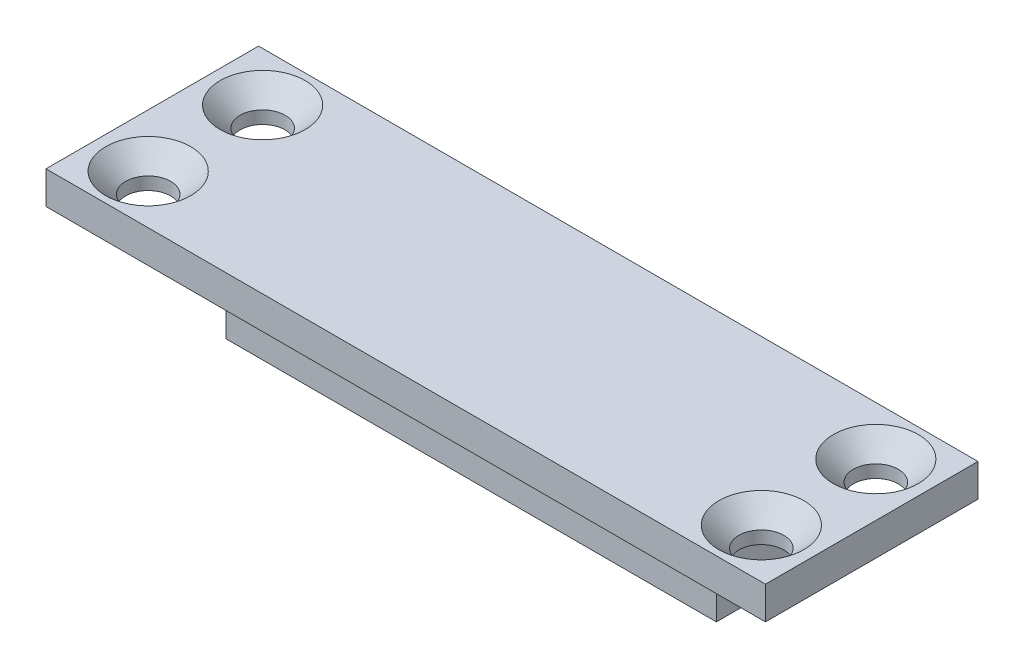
ISO-10303-21;
HEADER;
FILE_DESCRIPTION(('STEP AP214'),'2;1');
FILE_NAME('part.step','',(''),(''),'','','');
FILE_SCHEMA(('AUTOMOTIVE_DESIGN { 1 0 10303 214 1 1 1 1 }'));
ENDSEC;
DATA;
#1=APPLICATION_CONTEXT('core data for automotive mechanical design processes');
#2=APPLICATION_PROTOCOL_DEFINITION('international standard','automotive_design',2000,#1);
#3=PRODUCT_CONTEXT('',#1,'mechanical');
#4=PRODUCT('Part','Part','',(#3));
#5=PRODUCT_RELATED_PRODUCT_CATEGORY('part','',(#4));
#6=PRODUCT_DEFINITION_FORMATION('','',#4);
#7=PRODUCT_DEFINITION_CONTEXT('part definition',#1,'design');
#8=PRODUCT_DEFINITION('design','',#6,#7);
#9=PRODUCT_DEFINITION_SHAPE('','',#8);
#10=(LENGTH_UNIT() NAMED_UNIT(*) SI_UNIT(.MILLI.,.METRE.));
#11=(NAMED_UNIT(*) PLANE_ANGLE_UNIT() SI_UNIT($,.RADIAN.));
#12=(NAMED_UNIT(*) SI_UNIT($,.STERADIAN.) SOLID_ANGLE_UNIT());
#13=UNCERTAINTY_MEASURE_WITH_UNIT(LENGTH_MEASURE(1.E-05),#10,'distance_accuracy_value','');
#14=(GEOMETRIC_REPRESENTATION_CONTEXT(3) GLOBAL_UNCERTAINTY_ASSIGNED_CONTEXT((#13)) GLOBAL_UNIT_ASSIGNED_CONTEXT((#10,
#11,#12)) REPRESENTATION_CONTEXT('',''));
#15=CARTESIAN_POINT('',(0.,0.,0.));
#16=DIRECTION('',(0.,0.,1.));
#17=DIRECTION('',(1.,0.,0.));
#18=AXIS2_PLACEMENT_3D('',#15,#16,#17);
#19=CARTESIAN_POINT('',(88.0000000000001,0.,13.));
#20=DIRECTION('',(0.,0.,-1.));
#21=DIRECTION('',(-1.,0.,0.));
#22=AXIS2_PLACEMENT_3D('',#19,#20,#21);
#23=PLANE('',#22);
#24=DIRECTION('',(0.,-1.,0.));
#25=VECTOR('',#24,1.);
#26=CARTESIAN_POINT('',(0.,0.,13.));
#27=LINE('',#26,#25);
#28=CARTESIAN_POINT('',(0.,0.,13.));
#29=VERTEX_POINT('',#28);
#30=CARTESIAN_POINT('',(0.,-4.,13.));
#31=VERTEX_POINT('',#30);
#32=EDGE_CURVE('E183',#29,#31,#27,.T.);
#33=ORIENTED_EDGE('',*,*,#32,.T.);
#34=DIRECTION('',(-1.,0.,0.));
#35=VECTOR('',#34,1.);
#36=CARTESIAN_POINT('',(88.0000000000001,-4.,13.));
#37=LINE('',#36,#35);
#38=CARTESIAN_POINT('',(88.0000000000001,-4.,13.));
#39=VERTEX_POINT('',#38);
#40=EDGE_CURVE('E11',#39,#31,#37,.T.);
#41=ORIENTED_EDGE('',*,*,#40,.F.);
#42=DIRECTION('',(0.,-1.,0.));
#43=VECTOR('',#42,1.);
#44=CARTESIAN_POINT('',(88.0000000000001,0.,13.));
#45=LINE('',#44,#43);
#46=CARTESIAN_POINT('',(88.0000000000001,0.,13.));
#47=VERTEX_POINT('',#46);
#48=EDGE_CURVE('E184',#47,#39,#45,.T.);
#49=ORIENTED_EDGE('',*,*,#48,.F.);
#50=DIRECTION('',(-1.,0.,0.));
#51=VECTOR('',#50,1.);
#52=CARTESIAN_POINT('',(88.0000000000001,0.,13.));
#53=LINE('',#52,#51);
#54=EDGE_CURVE('E190',#47,#29,#53,.T.);
#55=ORIENTED_EDGE('',*,*,#54,.T.);
#56=EDGE_LOOP('',(#33,#41,#49,#55));
#57=FACE_BOUND('',#56,.T.);
#58=ADVANCED_FACE('F34',(#57),#23,.F.);
#59=CARTESIAN_POINT('',(88.0000000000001,-4.,5.00000000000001));
#60=DIRECTION('',(0.,0.,-1.));
#61=DIRECTION('',(0.,1.,0.));
#62=AXIS2_PLACEMENT_3D('',#59,#60,#61);
#63=PLANE('',#62);
#64=DIRECTION('',(-1.,0.,0.));
#65=VECTOR('',#64,1.);
#66=CARTESIAN_POINT('',(88.0000000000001,-15.,5.00000000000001));
#67=LINE('',#66,#65);
#68=CARTESIAN_POINT('',(74.0000000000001,-15.,5.));
#69=VERTEX_POINT('',#68);
#70=CARTESIAN_POINT('',(14.,-15.,5.00000000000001));
#71=VERTEX_POINT('',#70);
#72=EDGE_CURVE('E134',#69,#71,#67,.T.);
#73=ORIENTED_EDGE('',*,*,#72,.F.);
#74=DIRECTION('',(0.,1.,0.));
#75=VECTOR('',#74,1.);
#76=CARTESIAN_POINT('',(74.0000000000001,-4.,5.00000000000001));
#77=LINE('',#76,#75);
#78=CARTESIAN_POINT('',(74.0000000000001,-4.,5.));
#79=VERTEX_POINT('',#78);
#80=EDGE_CURVE('E117',#69,#79,#77,.T.);
#81=ORIENTED_EDGE('',*,*,#80,.T.);
#82=DIRECTION('',(-1.,0.,0.));
#83=VECTOR('',#82,1.);
#84=CARTESIAN_POINT('',(88.0000000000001,-4.,5.00000000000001));
#85=LINE('',#84,#83);
#86=CARTESIAN_POINT('',(14.,-4.,5.00000000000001));
#87=VERTEX_POINT('',#86);
#88=EDGE_CURVE('E43',#79,#87,#85,.T.);
#89=ORIENTED_EDGE('',*,*,#88,.T.);
#90=DIRECTION('',(0.,-1.,0.));
#91=VECTOR('',#90,1.);
#92=CARTESIAN_POINT('',(14.,-4.00000000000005,5.00000000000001));
#93=LINE('',#92,#91);
#94=EDGE_CURVE('E180',#87,#71,#93,.T.);
#95=ORIENTED_EDGE('',*,*,#94,.T.);
#96=EDGE_LOOP('',(#73,#81,#89,#95));
#97=FACE_BOUND('',#96,.T.);
#98=ADVANCED_FACE('F220',(#97),#63,.F.);
#99=CARTESIAN_POINT('',(88.0000000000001,-15.,5.00000000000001));
#100=DIRECTION('',(0.,1.,0.));
#101=DIRECTION('',(0.,0.,1.));
#102=AXIS2_PLACEMENT_3D('',#99,#100,#101);
#103=PLANE('',#102);
#104=DIRECTION('',(-1.,0.,0.));
#105=VECTOR('',#104,1.);
#106=CARTESIAN_POINT('',(88.0000000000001,-15.,-5.00000000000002));
#107=LINE('',#106,#105);
#108=CARTESIAN_POINT('',(74.0000000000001,-15.,-5.00000000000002));
#109=VERTEX_POINT('',#108);
#110=CARTESIAN_POINT('',(14.,-15.,-5.00000000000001));
#111=VERTEX_POINT('',#110);
#112=EDGE_CURVE('E131',#109,#111,#107,.T.);
#113=ORIENTED_EDGE('',*,*,#112,.F.);
#114=DIRECTION('',(0.,0.,1.));
#115=VECTOR('',#114,1.);
#116=CARTESIAN_POINT('',(74.0000000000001,-15.,-33.5000000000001));
#117=LINE('',#116,#115);
#118=EDGE_CURVE('E113',#109,#69,#117,.T.);
#119=ORIENTED_EDGE('',*,*,#118,.T.);
#120=ORIENTED_EDGE('',*,*,#72,.T.);
#121=DIRECTION('',(0.,0.,1.));
#122=VECTOR('',#121,1.);
#123=CARTESIAN_POINT('',(14.,-15.,-33.5000000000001));
#124=LINE('',#123,#122);
#125=EDGE_CURVE('E174',#111,#71,#124,.T.);
#126=ORIENTED_EDGE('',*,*,#125,.F.);
#127=EDGE_LOOP('',(#113,#119,#120,#126));
#128=FACE_BOUND('',#127,.T.);
#129=ADVANCED_FACE('F224',(#128),#103,.F.);
#130=CARTESIAN_POINT('',(88.0000000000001,-4.,-5.00000000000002));
#131=DIRECTION('',(0.,0.,1.));
#132=DIRECTION('',(0.,-1.,0.));
#133=AXIS2_PLACEMENT_3D('',#130,#131,#132);
#134=PLANE('',#133);
#135=DIRECTION('',(-1.,0.,0.));
#136=VECTOR('',#135,1.);
#137=CARTESIAN_POINT('',(88.0000000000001,-4.,-5.00000000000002));
#138=LINE('',#137,#136);
#139=CARTESIAN_POINT('',(74.0000000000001,-4.,-5.00000000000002));
#140=VERTEX_POINT('',#139);
#141=CARTESIAN_POINT('',(14.,-4.,-5.00000000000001));
#142=VERTEX_POINT('',#141);
#143=EDGE_CURVE('E123',#140,#142,#138,.T.);
#144=ORIENTED_EDGE('',*,*,#143,.F.);
#145=DIRECTION('',(0.,-1.,0.));
#146=VECTOR('',#145,1.);
#147=CARTESIAN_POINT('',(74.0000000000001,-4.,-5.00000000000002));
#148=LINE('',#147,#146);
#149=EDGE_CURVE('E107',#140,#109,#148,.T.);
#150=ORIENTED_EDGE('',*,*,#149,.T.);
#151=ORIENTED_EDGE('',*,*,#112,.T.);
#152=DIRECTION('',(0.,1.,0.));
#153=VECTOR('',#152,1.);
#154=CARTESIAN_POINT('',(14.,-4.00000000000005,-5.00000000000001));
#155=LINE('',#154,#153);
#156=EDGE_CURVE('E130',#111,#142,#155,.T.);
#157=ORIENTED_EDGE('',*,*,#156,.T.);
#158=EDGE_LOOP('',(#144,#150,#151,#157));
#159=FACE_BOUND('',#158,.T.);
#160=ADVANCED_FACE('F128',(#159),#134,.F.);
#161=CARTESIAN_POINT('',(88.0000000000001,-4.,-5.00000000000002));
#162=DIRECTION('',(0.,1.,0.));
#163=DIRECTION('',(0.,0.,1.));
#164=AXIS2_PLACEMENT_3D('',#161,#162,#163);
#165=PLANE('',#164);
#166=CARTESIAN_POINT('',(6.50000000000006,-4.,7.00000000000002));
#167=DIRECTION('',(0.,1.,0.));
#168=DIRECTION('',(0.,0.,1.));
#169=AXIS2_PLACEMENT_3D('',#166,#167,#168);
#170=CIRCLE('',#169,2.75);
#171=CARTESIAN_POINT('',(6.50000000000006,-4.,9.75000000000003));
#172=VERTEX_POINT('',#171);
#173=EDGE_CURVE('E37',#172,#172,#170,.T.);
#174=ORIENTED_EDGE('',*,*,#173,.T.);
#175=EDGE_LOOP('',(#174));
#176=FACE_BOUND('',#175,.T.);
#177=CARTESIAN_POINT('',(6.50000000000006,-4.,-7.00000000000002));
#178=DIRECTION('',(0.,1.,0.));
#179=DIRECTION('',(0.,0.,1.));
#180=AXIS2_PLACEMENT_3D('',#177,#178,#179);
#181=CIRCLE('',#180,2.75);
#182=CARTESIAN_POINT('',(6.50000000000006,-4.,-4.25000000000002));
#183=VERTEX_POINT('',#182);
#184=EDGE_CURVE('E149',#183,#183,#181,.T.);
#185=ORIENTED_EDGE('',*,*,#184,.T.);
#186=EDGE_LOOP('',(#185));
#187=FACE_BOUND('',#186,.T.);
#188=CARTESIAN_POINT('',(81.5,-4.,-7.00000000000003));
#189=DIRECTION('',(0.,1.,0.));
#190=DIRECTION('',(0.,0.,1.));
#191=AXIS2_PLACEMENT_3D('',#188,#189,#190);
#192=CIRCLE('',#191,2.75);
#193=CARTESIAN_POINT('',(81.5,-4.,-4.25000000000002));
#194=VERTEX_POINT('',#193);
#195=EDGE_CURVE('E145',#194,#194,#192,.T.);
#196=ORIENTED_EDGE('',*,*,#195,.T.);
#197=EDGE_LOOP('',(#196));
#198=FACE_BOUND('',#197,.T.);
#199=CARTESIAN_POINT('',(81.5,-4.,7.00000000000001));
#200=DIRECTION('',(0.,1.,0.));
#201=DIRECTION('',(0.,0.,1.));
#202=AXIS2_PLACEMENT_3D('',#199,#200,#201);
#203=CIRCLE('',#202,2.75);
#204=CARTESIAN_POINT('',(81.5,-4.,9.75000000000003));
#205=VERTEX_POINT('',#204);
#206=EDGE_CURVE('E125',#205,#205,#203,.T.);
#207=ORIENTED_EDGE('',*,*,#206,.T.);
#208=EDGE_LOOP('',(#207));
#209=FACE_BOUND('',#208,.T.);
#210=ORIENTED_EDGE('',*,*,#88,.F.);
#211=DIRECTION('',(0.,0.,1.));
#212=VECTOR('',#211,1.);
#213=CARTESIAN_POINT('',(74.0000000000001,-4.,-33.5000000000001));
#214=LINE('',#213,#212);
#215=EDGE_CURVE('E110',#140,#79,#214,.T.);
#216=ORIENTED_EDGE('',*,*,#215,.F.);
#217=ORIENTED_EDGE('',*,*,#143,.T.);
#218=DIRECTION('',(0.,0.,1.));
#219=VECTOR('',#218,1.);
#220=CARTESIAN_POINT('',(14.,-4.,-33.5000000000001));
#221=LINE('',#220,#219);
#222=EDGE_CURVE('E175',#142,#87,#221,.T.);
#223=ORIENTED_EDGE('',*,*,#222,.T.);
#224=EDGE_LOOP('',(#210,#216,#217,#223));
#225=FACE_BOUND('',#224,.T.);
#226=DIRECTION('',(0.,0.,-1.));
#227=VECTOR('',#226,1.);
#228=CARTESIAN_POINT('',(0.,-4.,-5.00000000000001));
#229=LINE('',#228,#227);
#230=CARTESIAN_POINT('',(0.,-4.,-13.));
#231=VERTEX_POINT('',#230);
#232=EDGE_CURVE('E193',#31,#231,#229,.T.);
#233=ORIENTED_EDGE('',*,*,#232,.T.);
#234=DIRECTION('',(-1.,0.,0.));
#235=VECTOR('',#234,1.);
#236=CARTESIAN_POINT('',(88.0000000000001,-4.,-13.));
#237=LINE('',#236,#235);
#238=CARTESIAN_POINT('',(88.0000000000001,-4.,-13.));
#239=VERTEX_POINT('',#238);
#240=EDGE_CURVE('E132',#239,#231,#237,.T.);
#241=ORIENTED_EDGE('',*,*,#240,.F.);
#242=DIRECTION('',(0.,0.,-1.));
#243=VECTOR('',#242,1.);
#244=CARTESIAN_POINT('',(88.0000000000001,-4.,13.));
#245=LINE('',#244,#243);
#246=EDGE_CURVE('E81',#39,#239,#245,.T.);
#247=ORIENTED_EDGE('',*,*,#246,.F.);
#248=ORIENTED_EDGE('',*,*,#40,.T.);
#249=EDGE_LOOP('',(#233,#241,#247,#248));
#250=FACE_BOUND('',#249,.T.);
#251=ADVANCED_FACE('F121',(#176,#187,#198,#209,#225,#250),#165,.F.);
#252=CARTESIAN_POINT('',(88.0000000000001,0.,-13.));
#253=DIRECTION('',(0.,0.,1.));
#254=DIRECTION('',(1.,0.,0.));
#255=AXIS2_PLACEMENT_3D('',#252,#253,#254);
#256=PLANE('',#255);
#257=DIRECTION('',(0.,1.,0.));
#258=VECTOR('',#257,1.);
#259=CARTESIAN_POINT('',(0.,0.,-13.));
#260=LINE('',#259,#258);
#261=CARTESIAN_POINT('',(0.,0.,-13.));
#262=VERTEX_POINT('',#261);
#263=EDGE_CURVE('E68',#231,#262,#260,.T.);
#264=ORIENTED_EDGE('',*,*,#263,.T.);
#265=DIRECTION('',(-1.,0.,0.));
#266=VECTOR('',#265,1.);
#267=CARTESIAN_POINT('',(88.0000000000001,0.,-13.));
#268=LINE('',#267,#266);
#269=CARTESIAN_POINT('',(88.0000000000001,0.,-13.));
#270=VERTEX_POINT('',#269);
#271=EDGE_CURVE('E136',#270,#262,#268,.T.);
#272=ORIENTED_EDGE('',*,*,#271,.F.);
#273=DIRECTION('',(0.,1.,0.));
#274=VECTOR('',#273,1.);
#275=CARTESIAN_POINT('',(88.0000000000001,0.,-13.));
#276=LINE('',#275,#274);
#277=EDGE_CURVE('E187',#239,#270,#276,.T.);
#278=ORIENTED_EDGE('',*,*,#277,.F.);
#279=ORIENTED_EDGE('',*,*,#240,.T.);
#280=EDGE_LOOP('',(#264,#272,#278,#279));
#281=FACE_BOUND('',#280,.T.);
#282=ADVANCED_FACE('F208',(#281),#256,.F.);
#283=CARTESIAN_POINT('',(88.0000000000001,0.,13.));
#284=DIRECTION('',(0.,-1.,0.));
#285=DIRECTION('',(0.,0.,-1.));
#286=AXIS2_PLACEMENT_3D('',#283,#284,#285);
#287=PLANE('',#286);
#288=CARTESIAN_POINT('',(6.50000000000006,0.,7.00000000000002));
#289=DIRECTION('',(0.,1.,0.));
#290=DIRECTION('',(0.,0.,1.));
#291=AXIS2_PLACEMENT_3D('',#288,#289,#290);
#292=CIRCLE('',#291,5.2);
#293=CARTESIAN_POINT('',(6.50000000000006,0.,12.2));
#294=VERTEX_POINT('',#293);
#295=EDGE_CURVE('E378',#294,#294,#292,.T.);
#296=ORIENTED_EDGE('',*,*,#295,.F.);
#297=EDGE_LOOP('',(#296));
#298=FACE_BOUND('',#297,.T.);
#299=CARTESIAN_POINT('',(6.50000000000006,0.,-7.00000000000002));
#300=DIRECTION('',(0.,1.,0.));
#301=DIRECTION('',(0.,0.,1.));
#302=AXIS2_PLACEMENT_3D('',#299,#300,#301);
#303=CIRCLE('',#302,5.2);
#304=CARTESIAN_POINT('',(6.50000000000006,0.,-1.80000000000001));
#305=VERTEX_POINT('',#304);
#306=EDGE_CURVE('E158',#305,#305,#303,.T.);
#307=ORIENTED_EDGE('',*,*,#306,.F.);
#308=EDGE_LOOP('',(#307));
#309=FACE_BOUND('',#308,.T.);
#310=CARTESIAN_POINT('',(81.5,0.,-7.00000000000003));
#311=DIRECTION('',(0.,1.,0.));
#312=DIRECTION('',(0.,0.,1.));
#313=AXIS2_PLACEMENT_3D('',#310,#311,#312);
#314=CIRCLE('',#313,5.2);
#315=CARTESIAN_POINT('',(81.5,0.,-1.80000000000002));
#316=VERTEX_POINT('',#315);
#317=EDGE_CURVE('E151',#316,#316,#314,.T.);
#318=ORIENTED_EDGE('',*,*,#317,.F.);
#319=EDGE_LOOP('',(#318));
#320=FACE_BOUND('',#319,.T.);
#321=CARTESIAN_POINT('',(81.5,0.,7.00000000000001));
#322=DIRECTION('',(0.,1.,0.));
#323=DIRECTION('',(0.,0.,1.));
#324=AXIS2_PLACEMENT_3D('',#321,#322,#323);
#325=CIRCLE('',#324,5.2);
#326=CARTESIAN_POINT('',(81.5,0.,12.2));
#327=VERTEX_POINT('',#326);
#328=EDGE_CURVE('E147',#327,#327,#325,.T.);
#329=ORIENTED_EDGE('',*,*,#328,.F.);
#330=EDGE_LOOP('',(#329));
#331=FACE_BOUND('',#330,.T.);
#332=DIRECTION('',(0.,0.,1.));
#333=VECTOR('',#332,1.);
#334=CARTESIAN_POINT('',(0.,0.,13.));
#335=LINE('',#334,#333);
#336=EDGE_CURVE('E74',#262,#29,#335,.T.);
#337=ORIENTED_EDGE('',*,*,#336,.T.);
#338=ORIENTED_EDGE('',*,*,#54,.F.);
#339=DIRECTION('',(0.,0.,1.));
#340=VECTOR('',#339,1.);
#341=CARTESIAN_POINT('',(88.0000000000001,0.,13.));
#342=LINE('',#341,#340);
#343=EDGE_CURVE('E52',#270,#47,#342,.T.);
#344=ORIENTED_EDGE('',*,*,#343,.F.);
#345=ORIENTED_EDGE('',*,*,#271,.T.);
#346=EDGE_LOOP('',(#337,#338,#344,#345));
#347=FACE_BOUND('',#346,.T.);
#348=ADVANCED_FACE('F198',(#298,#309,#320,#331,#347),#287,.F.);
#349=CARTESIAN_POINT('',(88.0000000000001,-4.,13.));
#350=DIRECTION('',(1.,0.,0.));
#351=DIRECTION('',(0.,0.,-1.));
#352=AXIS2_PLACEMENT_3D('',#349,#350,#351);
#353=PLANE('',#352);
#354=ORIENTED_EDGE('',*,*,#246,.T.);
#355=ORIENTED_EDGE('',*,*,#277,.T.);
#356=ORIENTED_EDGE('',*,*,#343,.T.);
#357=ORIENTED_EDGE('',*,*,#48,.T.);
#358=EDGE_LOOP('',(#354,#355,#356,#357));
#359=FACE_BOUND('',#358,.T.);
#360=ADVANCED_FACE('F207',(#359),#353,.T.);
#361=CARTESIAN_POINT('',(0.,-4.,13.));
#362=DIRECTION('',(1.,0.,0.));
#363=DIRECTION('',(0.,0.,-1.));
#364=AXIS2_PLACEMENT_3D('',#361,#362,#363);
#365=PLANE('',#364);
#366=ORIENTED_EDGE('',*,*,#232,.F.);
#367=ORIENTED_EDGE('',*,*,#32,.F.);
#368=ORIENTED_EDGE('',*,*,#336,.F.);
#369=ORIENTED_EDGE('',*,*,#263,.F.);
#370=EDGE_LOOP('',(#366,#367,#368,#369));
#371=FACE_BOUND('',#370,.T.);
#372=ADVANCED_FACE('F203',(#371),#365,.F.);
#373=CARTESIAN_POINT('',(14.,-4.,-33.5000000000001));
#374=DIRECTION('',(1.,0.,0.));
#375=DIRECTION('',(0.,1.,0.));
#376=AXIS2_PLACEMENT_3D('',#373,#374,#375);
#377=PLANE('',#376);
#378=ORIENTED_EDGE('',*,*,#222,.F.);
#379=ORIENTED_EDGE('',*,*,#156,.F.);
#380=ORIENTED_EDGE('',*,*,#125,.T.);
#381=ORIENTED_EDGE('',*,*,#94,.F.);
#382=EDGE_LOOP('',(#378,#379,#380,#381));
#383=FACE_BOUND('',#382,.T.);
#384=ADVANCED_FACE('F272',(#383),#377,.F.);
#385=CARTESIAN_POINT('',(74.0000000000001,-4.,-33.5000000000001));
#386=DIRECTION('',(-1.,0.,0.));
#387=DIRECTION('',(0.,0.,1.));
#388=AXIS2_PLACEMENT_3D('',#385,#386,#387);
#389=PLANE('',#388);
#390=ORIENTED_EDGE('',*,*,#118,.F.);
#391=ORIENTED_EDGE('',*,*,#149,.F.);
#392=ORIENTED_EDGE('',*,*,#215,.T.);
#393=ORIENTED_EDGE('',*,*,#80,.F.);
#394=EDGE_LOOP('',(#390,#391,#392,#393));
#395=FACE_BOUND('',#394,.T.);
#396=ADVANCED_FACE('F109',(#395),#389,.F.);
#397=CARTESIAN_POINT('',(81.5,0.,7.00000000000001));
#398=DIRECTION('',(0.,1.,0.));
#399=DIRECTION('',(0.,0.,1.));
#400=AXIS2_PLACEMENT_3D('',#397,#398,#399);
#401=CYLINDRICAL_SURFACE('',#400,2.75);
#402=CARTESIAN_POINT('',(81.5,-2.45,7.00000000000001));
#403=DIRECTION('',(0.,1.,0.));
#404=DIRECTION('',(0.,0.,1.));
#405=AXIS2_PLACEMENT_3D('',#402,#403,#404);
#406=CIRCLE('',#405,2.75);
#407=CARTESIAN_POINT('',(81.5,-2.45,9.75000000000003));
#408=VERTEX_POINT('',#407);
#409=EDGE_CURVE('E144',#408,#408,#406,.T.);
#410=ORIENTED_EDGE('',*,*,#409,.T.);
#411=EDGE_LOOP('',(#410));
#412=FACE_BOUND('',#411,.T.);
#413=ORIENTED_EDGE('',*,*,#206,.F.);
#414=EDGE_LOOP('',(#413));
#415=FACE_BOUND('',#414,.T.);
#416=ADVANCED_FACE('F290',(#412,#415),#401,.F.);
#417=CARTESIAN_POINT('',(81.5,0.,7.00000000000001));
#418=DIRECTION('',(0.,1.,0.));
#419=DIRECTION('',(0.,0.,1.));
#420=AXIS2_PLACEMENT_3D('',#417,#418,#419);
#421=CONICAL_SURFACE('',#420,5.2,0.785398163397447);
#422=ORIENTED_EDGE('',*,*,#409,.F.);
#423=EDGE_LOOP('',(#422));
#424=FACE_BOUND('',#423,.T.);
#425=ORIENTED_EDGE('',*,*,#328,.T.);
#426=EDGE_LOOP('',(#425));
#427=FACE_BOUND('',#426,.T.);
#428=ADVANCED_FACE('F299',(#424,#427),#421,.F.);
#429=CARTESIAN_POINT('',(81.5,0.,-7.00000000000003));
#430=DIRECTION('',(0.,1.,0.));
#431=DIRECTION('',(0.,0.,1.));
#432=AXIS2_PLACEMENT_3D('',#429,#430,#431);
#433=CYLINDRICAL_SURFACE('',#432,2.75);
#434=CARTESIAN_POINT('',(81.5,-2.45,-7.00000000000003));
#435=DIRECTION('',(0.,1.,0.));
#436=DIRECTION('',(0.,0.,1.));
#437=AXIS2_PLACEMENT_3D('',#434,#435,#436);
#438=CIRCLE('',#437,2.75);
#439=CARTESIAN_POINT('',(81.5,-2.45,-4.25000000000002));
#440=VERTEX_POINT('',#439);
#441=EDGE_CURVE('E148',#440,#440,#438,.T.);
#442=ORIENTED_EDGE('',*,*,#441,.T.);
#443=EDGE_LOOP('',(#442));
#444=FACE_BOUND('',#443,.T.);
#445=ORIENTED_EDGE('',*,*,#195,.F.);
#446=EDGE_LOOP('',(#445));
#447=FACE_BOUND('',#446,.T.);
#448=ADVANCED_FACE('F309',(#444,#447),#433,.F.);
#449=CARTESIAN_POINT('',(81.5,0.,-7.00000000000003));
#450=DIRECTION('',(0.,1.,0.));
#451=DIRECTION('',(0.,0.,1.));
#452=AXIS2_PLACEMENT_3D('',#449,#450,#451);
#453=CONICAL_SURFACE('',#452,5.2,0.785398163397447);
#454=ORIENTED_EDGE('',*,*,#441,.F.);
#455=EDGE_LOOP('',(#454));
#456=FACE_BOUND('',#455,.T.);
#457=ORIENTED_EDGE('',*,*,#317,.T.);
#458=EDGE_LOOP('',(#457));
#459=FACE_BOUND('',#458,.T.);
#460=ADVANCED_FACE('F319',(#456,#459),#453,.F.);
#461=CARTESIAN_POINT('',(6.50000000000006,0.,-7.00000000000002));
#462=DIRECTION('',(0.,1.,0.));
#463=DIRECTION('',(0.,0.,1.));
#464=AXIS2_PLACEMENT_3D('',#461,#462,#463);
#465=CYLINDRICAL_SURFACE('',#464,2.75);
#466=CARTESIAN_POINT('',(6.50000000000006,-2.45,-7.00000000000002));
#467=DIRECTION('',(0.,1.,0.));
#468=DIRECTION('',(0.,0.,1.));
#469=AXIS2_PLACEMENT_3D('',#466,#467,#468);
#470=CIRCLE('',#469,2.75);
#471=CARTESIAN_POINT('',(6.50000000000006,-2.45,-4.25000000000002));
#472=VERTEX_POINT('',#471);
#473=EDGE_CURVE('E152',#472,#472,#470,.T.);
#474=ORIENTED_EDGE('',*,*,#473,.T.);
#475=EDGE_LOOP('',(#474));
#476=FACE_BOUND('',#475,.T.);
#477=ORIENTED_EDGE('',*,*,#184,.F.);
#478=EDGE_LOOP('',(#477));
#479=FACE_BOUND('',#478,.T.);
#480=ADVANCED_FACE('F329',(#476,#479),#465,.F.);
#481=CARTESIAN_POINT('',(6.50000000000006,0.,-7.00000000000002));
#482=DIRECTION('',(0.,1.,0.));
#483=DIRECTION('',(0.,0.,1.));
#484=AXIS2_PLACEMENT_3D('',#481,#482,#483);
#485=CONICAL_SURFACE('',#484,5.2,0.785398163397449);
#486=ORIENTED_EDGE('',*,*,#473,.F.);
#487=EDGE_LOOP('',(#486));
#488=FACE_BOUND('',#487,.T.);
#489=ORIENTED_EDGE('',*,*,#306,.T.);
#490=EDGE_LOOP('',(#489));
#491=FACE_BOUND('',#490,.T.);
#492=ADVANCED_FACE('F339',(#488,#491),#485,.F.);
#493=CARTESIAN_POINT('',(6.50000000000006,0.,7.00000000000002));
#494=DIRECTION('',(0.,1.,0.));
#495=DIRECTION('',(0.,0.,1.));
#496=AXIS2_PLACEMENT_3D('',#493,#494,#495);
#497=CYLINDRICAL_SURFACE('',#496,2.75);
#498=CARTESIAN_POINT('',(6.50000000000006,-2.45,7.00000000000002));
#499=DIRECTION('',(0.,1.,0.));
#500=DIRECTION('',(0.,0.,1.));
#501=AXIS2_PLACEMENT_3D('',#498,#499,#500);
#502=CIRCLE('',#501,2.75);
#503=CARTESIAN_POINT('',(6.50000000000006,-2.45,9.75000000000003));
#504=VERTEX_POINT('',#503);
#505=EDGE_CURVE('E375',#504,#504,#502,.T.);
#506=ORIENTED_EDGE('',*,*,#505,.T.);
#507=EDGE_LOOP('',(#506));
#508=FACE_BOUND('',#507,.T.);
#509=ORIENTED_EDGE('',*,*,#173,.F.);
#510=EDGE_LOOP('',(#509));
#511=FACE_BOUND('',#510,.T.);
#512=ADVANCED_FACE('F348',(#508,#511),#497,.F.);
#513=CARTESIAN_POINT('',(6.50000000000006,0.,7.00000000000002));
#514=DIRECTION('',(0.,1.,0.));
#515=DIRECTION('',(0.,0.,1.));
#516=AXIS2_PLACEMENT_3D('',#513,#514,#515);
#517=CONICAL_SURFACE('',#516,5.2,0.785398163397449);
#518=ORIENTED_EDGE('',*,*,#505,.F.);
#519=EDGE_LOOP('',(#518));
#520=FACE_BOUND('',#519,.T.);
#521=ORIENTED_EDGE('',*,*,#295,.T.);
#522=EDGE_LOOP('',(#521));
#523=FACE_BOUND('',#522,.T.);
#524=ADVANCED_FACE('F358',(#520,#523),#517,.F.);
#525=CLOSED_SHELL('',(#58,#98,#129,#160,#251,#282,#348,#360,#372,#384,#396,#416,#428,#448,#460,
#480,#492,#512,#524));
#526=MANIFOLD_SOLID_BREP('B2',#525);
#527=ADVANCED_BREP_SHAPE_REPRESENTATION('',(#18,#526),#14);
#528=SHAPE_DEFINITION_REPRESENTATION(#9,#527);
ENDSEC;
END-ISO-10303-21;
